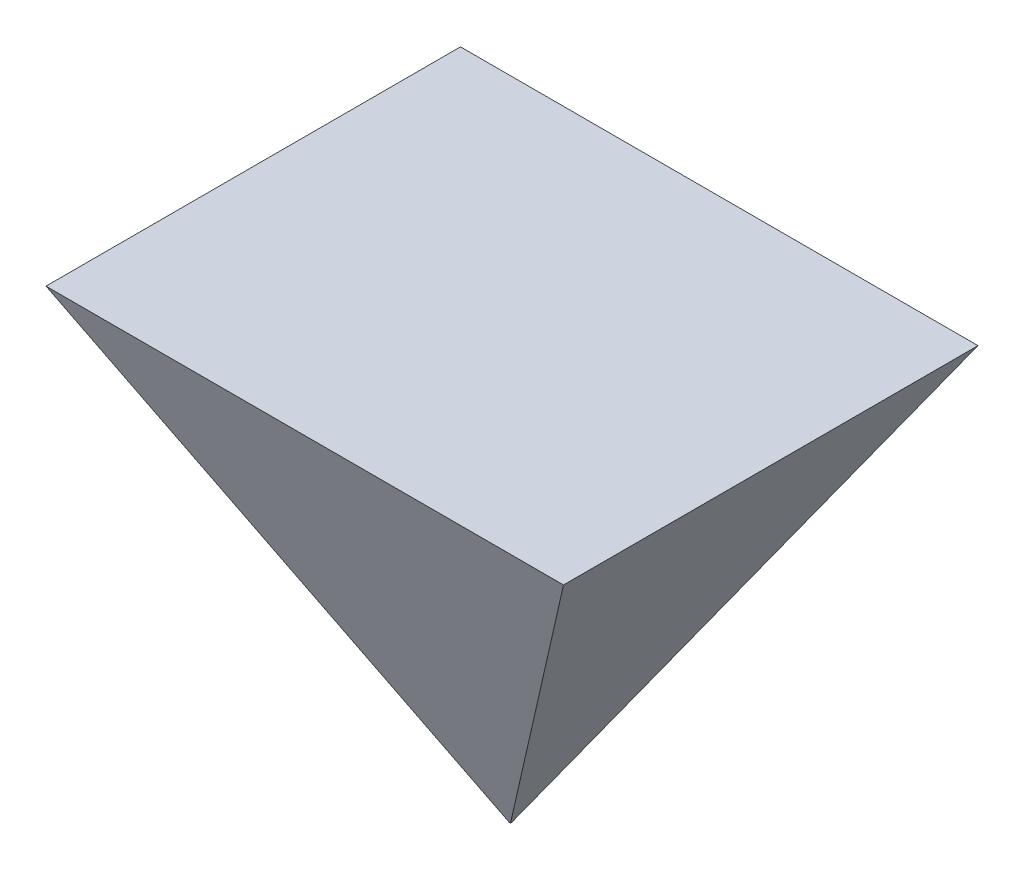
ISO-10303-21;
HEADER;
FILE_DESCRIPTION(('STEP AP214'),'2;1');
FILE_NAME('part.step','',(''),(''),'','','');
FILE_SCHEMA(('AUTOMOTIVE_DESIGN { 1 0 10303 214 1 1 1 1 }'));
ENDSEC;
DATA;
#1=APPLICATION_CONTEXT('core data for automotive mechanical design processes');
#2=APPLICATION_PROTOCOL_DEFINITION('international standard','automotive_design',2000,#1);
#3=PRODUCT_CONTEXT('',#1,'mechanical');
#4=PRODUCT('Part','Part','',(#3));
#5=PRODUCT_RELATED_PRODUCT_CATEGORY('part','',(#4));
#6=PRODUCT_DEFINITION_FORMATION('','',#4);
#7=PRODUCT_DEFINITION_CONTEXT('part definition',#1,'design');
#8=PRODUCT_DEFINITION('design','',#6,#7);
#9=PRODUCT_DEFINITION_SHAPE('','',#8);
#10=(LENGTH_UNIT() NAMED_UNIT(*) SI_UNIT(.MILLI.,.METRE.));
#11=(NAMED_UNIT(*) PLANE_ANGLE_UNIT() SI_UNIT($,.RADIAN.));
#12=(NAMED_UNIT(*) SI_UNIT($,.STERADIAN.) SOLID_ANGLE_UNIT());
#13=UNCERTAINTY_MEASURE_WITH_UNIT(LENGTH_MEASURE(1.E-05),#10,'distance_accuracy_value','');
#14=(GEOMETRIC_REPRESENTATION_CONTEXT(3) GLOBAL_UNCERTAINTY_ASSIGNED_CONTEXT((#13)) GLOBAL_UNIT_ASSIGNED_CONTEXT((#10,
#11,#12)) REPRESENTATION_CONTEXT('',''));
#15=CARTESIAN_POINT('',(0.,0.,0.));
#16=DIRECTION('',(0.,0.,1.));
#17=DIRECTION('',(1.,0.,0.));
#18=AXIS2_PLACEMENT_3D('',#15,#16,#17);
#19=CARTESIAN_POINT('',(2946.4,4978.4,-2354.58));
#20=DIRECTION('',(0.,1.,0.));
#21=DIRECTION('',(0.,0.,1.));
#22=AXIS2_PLACEMENT_3D('',#19,#20,#21);
#23=PLANE('',#22);
#24=DIRECTION('',(0.,0.,-1.));
#25=VECTOR('',#24,1.);
#26=CARTESIAN_POINT('',(2946.4,4978.4,2344.42));
#27=LINE('',#26,#25);
#28=CARTESIAN_POINT('',(2946.4,4978.4,2344.42));
#29=VERTEX_POINT('',#28);
#30=CARTESIAN_POINT('',(2946.4,4978.4,-2354.58));
#31=VERTEX_POINT('',#30);
#32=EDGE_CURVE('E135',#29,#31,#27,.T.);
#33=ORIENTED_EDGE('',*,*,#32,.T.);
#34=DIRECTION('',(-1.,0.,0.));
#35=VECTOR('',#34,1.);
#36=CARTESIAN_POINT('',(2946.4,4978.4,-2354.58));
#37=LINE('',#36,#35);
#38=CARTESIAN_POINT('',(-2921.,4978.4,-2354.58));
#39=VERTEX_POINT('',#38);
#40=EDGE_CURVE('E108',#31,#39,#37,.T.);
#41=ORIENTED_EDGE('',*,*,#40,.T.);
#42=DIRECTION('',(0.,0.,1.));
#43=VECTOR('',#42,1.);
#44=CARTESIAN_POINT('',(-2921.,4978.4,2344.42));
#45=LINE('',#44,#43);
#46=CARTESIAN_POINT('',(-2921.,4978.4,2344.42));
#47=VERTEX_POINT('',#46);
#48=EDGE_CURVE('E90',#39,#47,#45,.T.);
#49=ORIENTED_EDGE('',*,*,#48,.T.);
#50=DIRECTION('',(1.,0.,0.));
#51=VECTOR('',#50,1.);
#52=CARTESIAN_POINT('',(2946.4,4978.4,2344.42));
#53=LINE('',#52,#51);
#54=EDGE_CURVE('E81',#47,#29,#53,.T.);
#55=ORIENTED_EDGE('',*,*,#54,.T.);
#56=EDGE_LOOP('',(#33,#41,#49,#55));
#57=FACE_BOUND('',#56,.T.);
#58=ADVANCED_FACE('F42',(#57),#23,.T.);
#59=CARTESIAN_POINT('',(-6.477,0.,5.334));
#60=DIRECTION('',(0.,1.,0.));
#61=DIRECTION('',(0.,0.,1.));
#62=AXIS2_PLACEMENT_3D('',#59,#60,#61);
#63=PLANE('',#62);
#64=DIRECTION('',(0.,0.,1.));
#65=VECTOR('',#64,1.);
#66=CARTESIAN_POINT('',(-6.477,0.,-5.3086));
#67=LINE('',#66,#65);
#68=CARTESIAN_POINT('',(-6.477,0.,-5.3086));
#69=VERTEX_POINT('',#68);
#70=CARTESIAN_POINT('',(-6.477,0.,5.334));
#71=VERTEX_POINT('',#70);
#72=EDGE_CURVE('E93',#69,#71,#67,.T.);
#73=ORIENTED_EDGE('',*,*,#72,.F.);
#74=DIRECTION('',(-1.,0.,0.));
#75=VECTOR('',#74,1.);
#76=CARTESIAN_POINT('',(-6.477,0.,-5.3086));
#77=LINE('',#76,#75);
#78=CARTESIAN_POINT('',(6.477,0.,-5.3086));
#79=VERTEX_POINT('',#78);
#80=EDGE_CURVE('E12',#79,#69,#77,.T.);
#81=ORIENTED_EDGE('',*,*,#80,.F.);
#82=DIRECTION('',(0.,0.,-1.));
#83=VECTOR('',#82,1.);
#84=CARTESIAN_POINT('',(6.477,0.,-5.3086));
#85=LINE('',#84,#83);
#86=CARTESIAN_POINT('',(6.477,0.,5.334));
#87=VERTEX_POINT('',#86);
#88=EDGE_CURVE('E53',#87,#79,#85,.T.);
#89=ORIENTED_EDGE('',*,*,#88,.F.);
#90=DIRECTION('',(1.,0.,0.));
#91=VECTOR('',#90,1.);
#92=CARTESIAN_POINT('',(-6.477,0.,5.334));
#93=LINE('',#92,#91);
#94=EDGE_CURVE('E62',#71,#87,#93,.T.);
#95=ORIENTED_EDGE('',*,*,#94,.F.);
#96=EDGE_LOOP('',(#73,#81,#89,#95));
#97=FACE_BOUND('',#96,.T.);
#98=ADVANCED_FACE('F174',(#97),#63,.F.);
#99=CARTESIAN_POINT('',(2946.4,4978.4,-2354.58));
#100=DIRECTION('',(-0.861067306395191,0.50849099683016,0.));
#101=DIRECTION('',(-0.50849099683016,-0.861067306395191,0.));
#102=AXIS2_PLACEMENT_3D('',#99,#100,#101);
#103=PLANE('',#102);
#104=DIRECTION('',(0.471086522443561,0.797727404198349,-0.376441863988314));
#105=VECTOR('',#104,1.);
#106=CARTESIAN_POINT('',(6.477,0.,-5.3086));
#107=LINE('',#106,#105);
#108=EDGE_CURVE('E157',#79,#31,#107,.T.);
#109=ORIENTED_EDGE('',*,*,#108,.T.);
#110=ORIENTED_EDGE('',*,*,#32,.F.);
#111=DIRECTION('',(0.471375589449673,0.798216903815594,0.375039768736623));
#112=VECTOR('',#111,1.);
#113=CARTESIAN_POINT('',(6.477,0.,5.334));
#114=LINE('',#113,#112);
#115=EDGE_CURVE('E102',#87,#29,#114,.T.);
#116=ORIENTED_EDGE('',*,*,#115,.F.);
#117=ORIENTED_EDGE('',*,*,#88,.T.);
#118=EDGE_LOOP('',(#109,#110,#116,#117));
#119=FACE_BOUND('',#118,.T.);
#120=ADVANCED_FACE('F154',(#119),#103,.F.);
#121=CARTESIAN_POINT('',(2946.4,4978.4,2344.42));
#122=DIRECTION('',(0.,0.425247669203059,-0.905077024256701));
#123=DIRECTION('',(0.,0.905077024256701,0.425247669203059));
#124=AXIS2_PLACEMENT_3D('',#121,#122,#123);
#125=PLANE('',#124);
#126=ORIENTED_EDGE('',*,*,#115,.T.);
#127=ORIENTED_EDGE('',*,*,#54,.F.);
#128=DIRECTION('',(-0.468198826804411,0.799747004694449,0.37575868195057));
#129=VECTOR('',#128,1.);
#130=CARTESIAN_POINT('',(-6.477,0.,5.334));
#131=LINE('',#130,#129);
#132=EDGE_CURVE('E87',#71,#47,#131,.T.);
#133=ORIENTED_EDGE('',*,*,#132,.F.);
#134=ORIENTED_EDGE('',*,*,#94,.T.);
#135=EDGE_LOOP('',(#126,#127,#133,#134));
#136=FACE_BOUND('',#135,.T.);
#137=ADVANCED_FACE('F100',(#136),#125,.F.);
#138=CARTESIAN_POINT('',(-2921.,4978.4,-2354.58));
#139=DIRECTION('',(0.,0.42676273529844,0.90436362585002));
#140=DIRECTION('',(0.,-0.90436362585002,0.42676273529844));
#141=AXIS2_PLACEMENT_3D('',#138,#139,#140);
#142=PLANE('',#141);
#143=DIRECTION('',(-0.467910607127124,0.799254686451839,-0.377162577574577));
#144=VECTOR('',#143,1.);
#145=CARTESIAN_POINT('',(-6.477,0.,-5.3086));
#146=LINE('',#145,#144);
#147=EDGE_CURVE('E96',#69,#39,#146,.T.);
#148=ORIENTED_EDGE('',*,*,#147,.T.);
#149=ORIENTED_EDGE('',*,*,#40,.F.);
#150=ORIENTED_EDGE('',*,*,#108,.F.);
#151=ORIENTED_EDGE('',*,*,#80,.T.);
#152=EDGE_LOOP('',(#148,#149,#150,#151));
#153=FACE_BOUND('',#152,.T.);
#154=ADVANCED_FACE('F212',(#153),#142,.F.);
#155=CARTESIAN_POINT('',(-2921.,4978.4,2344.42));
#156=DIRECTION('',(0.862988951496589,0.505222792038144,0.));
#157=DIRECTION('',(-0.505222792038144,0.862988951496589,0.));
#158=AXIS2_PLACEMENT_3D('',#155,#156,#157);
#159=PLANE('',#158);
#160=ORIENTED_EDGE('',*,*,#132,.T.);
#161=ORIENTED_EDGE('',*,*,#48,.F.);
#162=ORIENTED_EDGE('',*,*,#147,.F.);
#163=ORIENTED_EDGE('',*,*,#72,.T.);
#164=EDGE_LOOP('',(#160,#161,#162,#163));
#165=FACE_BOUND('',#164,.T.);
#166=ADVANCED_FACE('F88',(#165),#159,.F.);
#167=CLOSED_SHELL('',(#58,#98,#120,#137,#154,#166));
#168=MANIFOLD_SOLID_BREP('B2',#167);
#169=ADVANCED_BREP_SHAPE_REPRESENTATION('',(#18,#168),#14);
#170=SHAPE_DEFINITION_REPRESENTATION(#9,#169);
ENDSEC;
END-ISO-10303-21;
